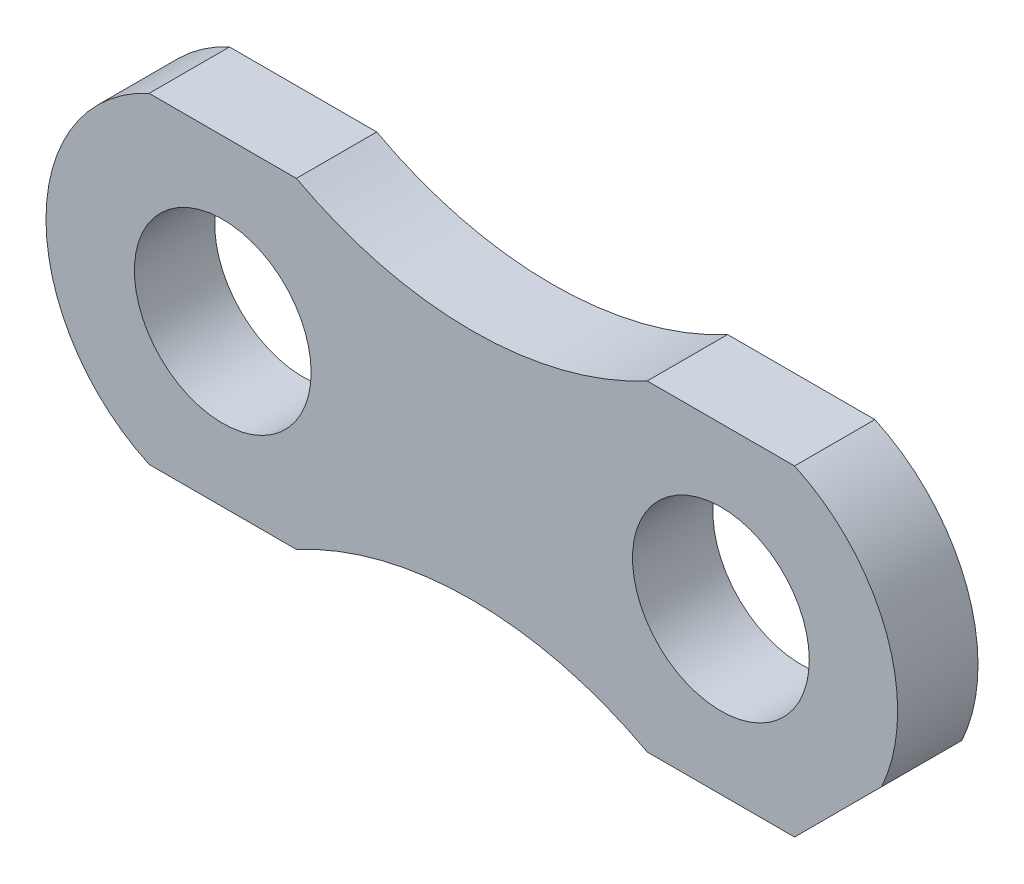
from build123d import *

# Parameters (mm, degrees)
ESQUISSE1_R        = 11
BOSS_EXTRU_1_DEPTH = 10


with BuildPart() as part:
    # Esquisse1 → Boss.-Extru.1 (new body)
    with BuildSketch(Plane.XY):
        with BuildLine():
            Line((-9.16515139, 20), (9.16515139, 20))
            ThreePointArc((9.16515139, 20), (31, 14.5), (52.83484861, 20))
            Line((52.83484861, 20), (71.16515139, 20))
            ThreePointArc((71.16515139, 20), (82.622876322, 7.661394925), (82, -9.16515139))
            Line((82, -9.16515139), (71.16515139, -20))
            Line((71.16515139, -20), (52.83484861, -20))
            ThreePointArc((52.83484861, -20), (31, -14.5), (9.16515139, -20))
            Line((9.16515139, -20), (-9.16515139, -20))
            ThreePointArc((-9.16515139, -20), (-22, 0), (-9.16515139, 20))
        make_face()
        Circle(ESQUISSE1_R, mode=Mode.SUBTRACT)
        with Locations((62, 0)):
            Circle(ESQUISSE1_R, mode=Mode.SUBTRACT)
    extrude(amount=BOSS_EXTRU_1_DEPTH)


solid = part.part
